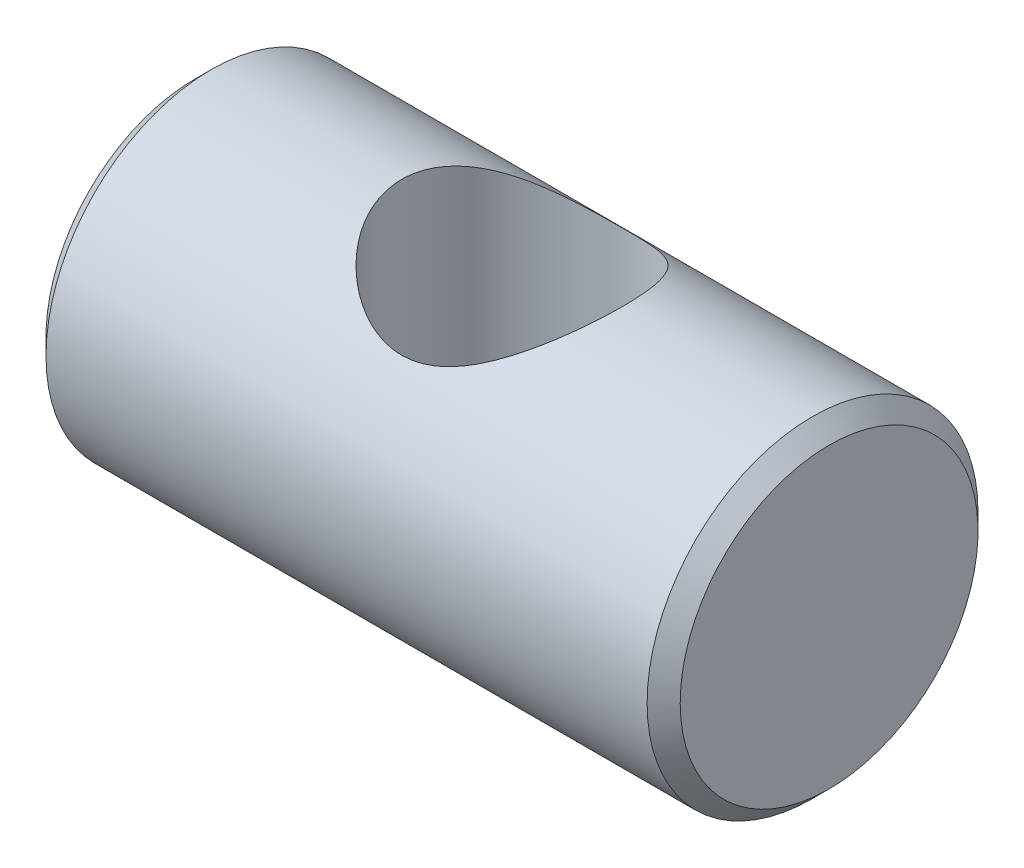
ISO-10303-21;
HEADER;
FILE_DESCRIPTION(('STEP AP214'),'2;1');
FILE_NAME('part.step','',(''),(''),'','','');
FILE_SCHEMA(('AUTOMOTIVE_DESIGN { 1 0 10303 214 1 1 1 1 }'));
ENDSEC;
DATA;
#1=APPLICATION_CONTEXT('core data for automotive mechanical design processes');
#2=APPLICATION_PROTOCOL_DEFINITION('international standard','automotive_design',2000,#1);
#3=PRODUCT_CONTEXT('',#1,'mechanical');
#4=PRODUCT('Part','Part','',(#3));
#5=PRODUCT_RELATED_PRODUCT_CATEGORY('part','',(#4));
#6=PRODUCT_DEFINITION_FORMATION('','',#4);
#7=PRODUCT_DEFINITION_CONTEXT('part definition',#1,'design');
#8=PRODUCT_DEFINITION('design','',#6,#7);
#9=PRODUCT_DEFINITION_SHAPE('','',#8);
#10=(LENGTH_UNIT() NAMED_UNIT(*) SI_UNIT(.MILLI.,.METRE.));
#11=(NAMED_UNIT(*) PLANE_ANGLE_UNIT() SI_UNIT($,.RADIAN.));
#12=(NAMED_UNIT(*) SI_UNIT($,.STERADIAN.) SOLID_ANGLE_UNIT());
#13=UNCERTAINTY_MEASURE_WITH_UNIT(LENGTH_MEASURE(1.E-05),#10,'distance_accuracy_value','');
#14=(GEOMETRIC_REPRESENTATION_CONTEXT(3) GLOBAL_UNCERTAINTY_ASSIGNED_CONTEXT((#13)) GLOBAL_UNIT_ASSIGNED_CONTEXT((#10,
#11,#12)) REPRESENTATION_CONTEXT('',''));
#15=CARTESIAN_POINT('',(0.,0.,0.));
#16=DIRECTION('',(0.,0.,1.));
#17=DIRECTION('',(1.,0.,0.));
#18=AXIS2_PLACEMENT_3D('',#15,#16,#17);
#19=CARTESIAN_POINT('',(5.75,2.7,0.));
#20=DIRECTION('',(-1.,0.,0.));
#21=DIRECTION('',(0.,0.,1.));
#22=AXIS2_PLACEMENT_3D('',#19,#20,#21);
#23=PLANE('',#22);
#24=CARTESIAN_POINT('',(5.75000000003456,0.,0.));
#25=DIRECTION('',(-1.,0.,0.));
#26=DIRECTION('',(0.,0.,1.));
#27=AXIS2_PLACEMENT_3D('',#24,#25,#26);
#28=CIRCLE('',#27,2.70000000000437);
#29=CARTESIAN_POINT('',(5.75000000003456,0.,2.70000000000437));
#30=VERTEX_POINT('',#29);
#31=EDGE_CURVE('E66',#30,#30,#28,.T.);
#32=ORIENTED_EDGE('',*,*,#31,.F.);
#33=EDGE_LOOP('',(#32));
#34=FACE_BOUND('',#33,.T.);
#35=ADVANCED_FACE('F14',(#34),#23,.F.);
#36=CARTESIAN_POINT('',(-5.75,0.,0.));
#37=DIRECTION('',(1.,0.,0.));
#38=DIRECTION('',(0.,0.,-1.));
#39=AXIS2_PLACEMENT_3D('',#36,#37,#38);
#40=PLANE('',#39);
#41=CARTESIAN_POINT('',(-5.74999999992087,0.,0.));
#42=DIRECTION('',(1.,0.,0.));
#43=DIRECTION('',(0.,0.,-1.));
#44=AXIS2_PLACEMENT_3D('',#41,#42,#43);
#45=CIRCLE('',#44,2.70000000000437);
#46=CARTESIAN_POINT('',(-5.74999999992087,0.,-2.70000000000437));
#47=VERTEX_POINT('',#46);
#48=EDGE_CURVE('E68',#47,#47,#45,.T.);
#49=ORIENTED_EDGE('',*,*,#48,.F.);
#50=EDGE_LOOP('',(#49));
#51=FACE_BOUND('',#50,.T.);
#52=ADVANCED_FACE('F56',(#51),#40,.F.);
#53=CARTESIAN_POINT('',(5.45000000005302,0.,0.));
#54=DIRECTION('',(-1.,0.,0.));
#55=DIRECTION('',(0.,0.,1.));
#56=AXIS2_PLACEMENT_3D('',#53,#54,#55);
#57=CONICAL_SURFACE('',#56,2.99999999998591,0.785398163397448);
#58=CARTESIAN_POINT('',(5.45,0.,0.));
#59=DIRECTION('',(1.,0.,0.));
#60=DIRECTION('',(0.,0.,-1.));
#61=AXIS2_PLACEMENT_3D('',#58,#59,#60);
#62=CIRCLE('',#61,3.);
#63=CARTESIAN_POINT('',(5.45,0.,-3.));
#64=VERTEX_POINT('',#63);
#65=EDGE_CURVE('E33',#64,#64,#62,.F.);
#66=ORIENTED_EDGE('',*,*,#65,.F.);
#67=EDGE_LOOP('',(#66));
#68=FACE_BOUND('',#67,.T.);
#69=ORIENTED_EDGE('',*,*,#31,.T.);
#70=EDGE_LOOP('',(#69));
#71=FACE_BOUND('',#70,.T.);
#72=ADVANCED_FACE('F62',(#68,#71),#57,.T.);
#73=CARTESIAN_POINT('',(-5.45000000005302,0.,0.));
#74=DIRECTION('',(1.,0.,0.));
#75=DIRECTION('',(0.,0.,-1.));
#76=AXIS2_PLACEMENT_3D('',#73,#74,#75);
#77=CONICAL_SURFACE('',#76,2.99999999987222,0.785398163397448);
#78=ORIENTED_EDGE('',*,*,#48,.T.);
#79=EDGE_LOOP('',(#78));
#80=FACE_BOUND('',#79,.T.);
#81=CARTESIAN_POINT('',(-5.45,0.,0.));
#82=DIRECTION('',(1.,0.,0.));
#83=DIRECTION('',(0.,0.,-1.));
#84=AXIS2_PLACEMENT_3D('',#81,#82,#83);
#85=CIRCLE('',#84,3.);
#86=CARTESIAN_POINT('',(-5.45,0.,-3.));
#87=VERTEX_POINT('',#86);
#88=EDGE_CURVE('E29',#87,#87,#85,.T.);
#89=ORIENTED_EDGE('',*,*,#88,.F.);
#90=EDGE_LOOP('',(#89));
#91=FACE_BOUND('',#90,.T.);
#92=ADVANCED_FACE('F53',(#80,#91),#77,.T.);
#93=CARTESIAN_POINT('',(5.75,0.,0.));
#94=DIRECTION('',(1.,0.,0.));
#95=DIRECTION('',(0.,0.,-1.));
#96=AXIS2_PLACEMENT_3D('',#93,#94,#95);
#97=CYLINDRICAL_SURFACE('',#96,3.);
#98=CARTESIAN_POINT('',(2.,-3.,0.));
#99=CARTESIAN_POINT('',(2.00000054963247,-3.0000004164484,0.100484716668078));
#100=CARTESIAN_POINT('',(1.9923860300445,-2.99490802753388,0.200969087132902));
#101=CARTESIAN_POINT('',(1.96240313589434,-2.97504652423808,0.398733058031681));
#102=CARTESIAN_POINT('',(1.9400277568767,-2.96027281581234,0.496011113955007));
#103=CARTESIAN_POINT('',(1.88189228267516,-2.92250482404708,0.684212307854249));
#104=CARTESIAN_POINT('',(1.84619485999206,-2.89954905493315,0.775162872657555));
#105=CARTESIAN_POINT('',(1.7629366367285,-2.8472613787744,0.94941529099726));
#106=CARTESIAN_POINT('',(1.71537411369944,-2.8179285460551,1.03271603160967));
#107=CARTESIAN_POINT('',(1.60534306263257,-2.75227329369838,1.19728470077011));
#108=CARTESIAN_POINT('',(1.54195213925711,-2.71556897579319,1.27778030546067));
#109=CARTESIAN_POINT('',(1.40426995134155,-2.63982313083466,1.42772804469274));
#110=CARTESIAN_POINT('',(1.32996307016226,-2.60077830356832,1.49716405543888));
#111=CARTESIAN_POINT('',(1.15894763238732,-2.51728264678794,1.63422297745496));
#112=CARTESIAN_POINT('',(1.06055434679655,-2.47295067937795,1.6998318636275));
#113=CARTESIAN_POINT('',(0.851636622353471,-2.3908414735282,1.81350357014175));
#114=CARTESIAN_POINT('',(0.741133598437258,-2.35305295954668,1.86159673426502));
#115=CARTESIAN_POINT('',(0.543288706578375,-2.29976266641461,1.92674035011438));
#116=CARTESIAN_POINT('',(0.458471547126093,-2.28097627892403,1.94874447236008));
#117=CARTESIAN_POINT('',(0.285255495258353,-2.25257969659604,1.98150617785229));
#118=CARTESIAN_POINT('',(0.19686305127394,-2.24295368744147,1.99228314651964));
#119=CARTESIAN_POINT('',(0.0185252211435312,-2.23436605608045,2.00191364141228));
#120=CARTESIAN_POINT('',(-0.0714250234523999,-2.23544802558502,2.00071842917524));
#121=CARTESIAN_POINT('',(-0.249634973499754,-2.24819775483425,1.98637581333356));
#122=CARTESIAN_POINT('',(-0.337893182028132,-2.25987448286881,1.97321828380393));
#123=CARTESIAN_POINT('',(-0.506467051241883,-2.29127185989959,1.93664994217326));
#124=CARTESIAN_POINT('',(-0.586961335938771,-2.31061488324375,1.91371711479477));
#125=CARTESIAN_POINT('',(-0.743023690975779,-2.35509622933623,1.85870118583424));
#126=CARTESIAN_POINT('',(-0.818590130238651,-2.3802364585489,1.8266150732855));
#127=CARTESIAN_POINT('',(-0.979025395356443,-2.43964196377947,1.74673818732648));
#128=CARTESIAN_POINT('',(-1.06265990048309,-2.47472317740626,1.69708052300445));
#129=CARTESIAN_POINT('',(-1.22138339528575,-2.54691537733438,1.58668960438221));
#130=CARTESIAN_POINT('',(-1.29646165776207,-2.58402882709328,1.52594268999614));
#131=CARTESIAN_POINT('',(-1.45254254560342,-2.66543343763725,1.37981165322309));
#132=CARTESIAN_POINT('',(-1.53133404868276,-2.7095474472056,1.29193938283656));
#133=CARTESIAN_POINT('',(-1.67319649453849,-2.79218100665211,1.10200799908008));
#134=CARTESIAN_POINT('',(-1.73628214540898,-2.83070577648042,0.999962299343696));
#135=CARTESIAN_POINT('',(-1.83347771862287,-2.89145404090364,0.80485782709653));
#136=CARTESIAN_POINT('',(-1.87084336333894,-2.9153926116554,0.71395764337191));
#137=CARTESIAN_POINT('',(-1.93210492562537,-2.95507719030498,0.526036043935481));
#138=CARTESIAN_POINT('',(-1.95601222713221,-2.97083012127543,0.42901987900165));
#139=CARTESIAN_POINT('',(-1.98916116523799,-2.99275882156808,0.23098545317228));
#140=CARTESIAN_POINT('',(-1.99833946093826,-2.99889322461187,0.129951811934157));
#141=CARTESIAN_POINT('',(-2.00124708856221,-3.00083114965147,-0.0724415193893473));
#142=CARTESIAN_POINT('',(-1.99497750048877,-2.99663539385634,-0.173801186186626));
#143=CARTESIAN_POINT('',(-1.96837594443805,-2.97899589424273,-0.366455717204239));
#144=CARTESIAN_POINT('',(-1.94906270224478,-2.96622246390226,-0.457957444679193));
#145=CARTESIAN_POINT('',(-1.89840431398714,-2.93318449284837,-0.636116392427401));
#146=CARTESIAN_POINT('',(-1.86705724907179,-2.91291875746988,-0.722772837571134));
#147=CARTESIAN_POINT('',(-1.79134770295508,-2.86496352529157,-0.894664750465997));
#148=CARTESIAN_POINT('',(-1.74631184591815,-2.83689870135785,-0.979496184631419));
#149=CARTESIAN_POINT('',(-1.64556671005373,-2.77601855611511,-1.14068302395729));
#150=CARTESIAN_POINT('',(-1.58985083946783,-2.74320030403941,-1.21703314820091));
#151=CARTESIAN_POINT('',(-1.45939213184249,-2.6695454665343,-1.37185445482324));
#152=CARTESIAN_POINT('',(-1.38303373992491,-2.62826156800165,-1.44875187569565));
#153=CARTESIAN_POINT('',(-1.21888857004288,-2.54571173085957,-1.58933968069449));
#154=CARTESIAN_POINT('',(-1.13109396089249,-2.50444582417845,-1.6530209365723));
#155=CARTESIAN_POINT('',(-0.952857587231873,-2.4293967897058,-1.76124776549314));
#156=CARTESIAN_POINT('',(-0.863267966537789,-2.39527597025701,-1.80695636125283));
#157=CARTESIAN_POINT('',(-0.676127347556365,-2.33438974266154,-1.88496213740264));
#158=CARTESIAN_POINT('',(-0.578591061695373,-2.30761112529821,-1.91728345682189));
#159=CARTESIAN_POINT('',(-0.395435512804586,-2.26933208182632,-1.9623584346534));
#160=CARTESIAN_POINT('',(-0.310828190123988,-2.25594998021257,-1.97758597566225));
#161=CARTESIAN_POINT('',(-0.139426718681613,-2.23879466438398,-1.99699205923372));
#162=CARTESIAN_POINT('',(-0.0526350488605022,-2.23501101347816,-2.00118260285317));
#163=CARTESIAN_POINT('',(0.120643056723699,-2.23764201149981,-1.99823921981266));
#164=CARTESIAN_POINT('',(0.207129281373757,-2.24406269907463,-1.99109858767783));
#165=CARTESIAN_POINT('',(0.377343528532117,-2.26610452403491,-1.96596997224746));
#166=CARTESIAN_POINT('',(0.461067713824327,-2.28173793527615,-1.94796751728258));
#167=CARTESIAN_POINT('',(0.645711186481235,-2.32526843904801,-1.89593035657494));
#168=CARTESIAN_POINT('',(0.745267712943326,-2.35532333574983,-1.85890187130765));
#169=CARTESIAN_POINT('',(0.935486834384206,-2.42222161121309,-1.7708452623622));
#170=CARTESIAN_POINT('',(1.02613669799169,-2.45907449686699,-1.71979748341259));
#171=CARTESIAN_POINT('',(1.19928188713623,-2.53617186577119,-1.60398280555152));
#172=CARTESIAN_POINT('',(1.28159874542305,-2.5764658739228,-1.53898309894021));
#173=CARTESIAN_POINT('',(1.43532247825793,-2.65628301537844,-1.39671768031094));
#174=CARTESIAN_POINT('',(1.50672599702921,-2.69580590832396,-1.31944821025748));
#175=CARTESIAN_POINT('',(1.64671210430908,-2.77631551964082,-1.14145732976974));
#176=CARTESIAN_POINT('',(1.71341864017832,-2.81669805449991,-1.03896166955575));
#177=CARTESIAN_POINT('',(1.8279132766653,-2.88777665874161,-0.820868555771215));
#178=CARTESIAN_POINT('',(1.87573110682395,-2.91848793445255,-0.705292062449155));
#179=CARTESIAN_POINT('',(1.94115457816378,-2.96101644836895,-0.491435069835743));
#180=CARTESIAN_POINT('',(1.96311103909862,-2.97551480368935,-0.395012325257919));
#181=CARTESIAN_POINT('',(1.9925280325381,-2.99500280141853,-0.199058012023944));
#182=CARTESIAN_POINT('',(1.99999945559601,-2.99999958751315,-0.0995288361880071));
#183=CARTESIAN_POINT('',(2.,-3.,0.));
#184=B_SPLINE_CURVE_WITH_KNOTS('',3,(#98,#99,#100,#101,#102,#103,#104,#105,#106,#107,#108,#109,
#110,#111,#112,#113,#114,#115,#116,#117,#118,#119,#120,#121,#122,#123,#124,#125,#126,#127,#128,
#129,#130,#131,#132,#133,#134,#135,#136,#137,#138,#139,#140,#141,#142,#143,#144,#145,#146,#147,
#148,#149,#150,#151,#152,#153,#154,#155,#156,#157,#158,#159,#160,#161,#162,#163,#164,#165,#166,
#167,#168,#169,#170,#171,#172,#173,#174,#175,#176,#177,#178,#179,#180,#181,#182,#183),
.UNSPECIFIED.,.T.,.F.,(4,2,2,2,2,2,2,2,2,2,2,2,2,2,2,2,2,2,2,2,2,2,2,2,2,2,2,2,2,2,2,2,2,2,2,2,
2,2,2,2,2,2,4),(0.,0.3010532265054,0.602249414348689,0.902046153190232,1.20188643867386,
1.52717029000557,1.85292411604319,2.23006683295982,2.60655305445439,2.87433693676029,
3.14165767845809,3.41006711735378,3.67870397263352,3.93548862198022,4.19235783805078,
4.50147574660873,4.81097703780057,5.18718954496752,5.56304840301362,5.86524087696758,
6.16717735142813,6.47040883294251,6.77361911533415,7.05553084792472,7.3374875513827,
7.63652346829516,7.93574454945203,8.28228176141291,8.62905753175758,8.94649935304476,
9.26336626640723,9.52324048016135,9.78283200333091,10.0425772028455,10.302669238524,
10.6320660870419,10.9619271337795,11.2977924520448,11.6337608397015,12.0179535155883,
12.4015390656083,12.6999529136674,12.9981423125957),.UNSPECIFIED.);
#185=CARTESIAN_POINT('',(2.,-3.,0.));
#186=VERTEX_POINT('',#185);
#187=EDGE_CURVE('E10',#186,#186,#184,.T.);
#188=ORIENTED_EDGE('',*,*,#187,.F.);
#189=EDGE_LOOP('',(#188));
#190=FACE_BOUND('',#189,.T.);
#191=CARTESIAN_POINT('',(0.,2.23606797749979,2.));
#192=CARTESIAN_POINT('',(0.0976283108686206,2.23607753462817,1.99999453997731));
#193=CARTESIAN_POINT('',(0.195290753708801,2.24258071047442,1.99278992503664));
#194=CARTESIAN_POINT('',(0.387119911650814,2.26731972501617,1.96458268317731));
#195=CARTESIAN_POINT('',(0.481280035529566,2.2855766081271,1.94355530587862));
#196=CARTESIAN_POINT('',(0.662735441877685,2.3305658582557,1.88935861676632));
#197=CARTESIAN_POINT('',(0.750087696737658,2.35721561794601,1.85630718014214));
#198=CARTESIAN_POINT('',(0.917865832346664,2.41584094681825,1.77934008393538));
#199=CARTESIAN_POINT('',(0.998290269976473,2.44781762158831,1.73542216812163));
#200=CARTESIAN_POINT('',(1.16364688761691,2.51946072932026,1.63002410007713));
#201=CARTESIAN_POINT('',(1.2473321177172,2.55954936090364,1.56687435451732));
#202=CARTESIAN_POINT('',(1.40400270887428,2.63944827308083,1.4281921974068));
#203=CARTESIAN_POINT('',(1.47697752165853,2.67925824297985,1.3526477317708));
#204=CARTESIAN_POINT('',(1.62064365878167,2.76088818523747,1.17815690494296));
#205=CARTESIAN_POINT('',(1.68948251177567,2.80216785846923,1.07740643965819));
#206=CARTESIAN_POINT('',(1.80864209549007,2.87558484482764,0.862470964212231));
#207=CARTESIAN_POINT('',(1.85898351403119,2.90773236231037,0.748301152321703));
#208=CARTESIAN_POINT('',(1.93355640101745,2.95599907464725,0.523249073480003));
#209=CARTESIAN_POINT('',(1.96008334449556,2.97351175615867,0.413434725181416));
#210=CARTESIAN_POINT('',(1.99418448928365,2.99609745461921,0.189695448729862));
#211=CARTESIAN_POINT('',(2.00178255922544,3.00118613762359,0.0757758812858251));
#212=CARTESIAN_POINT('',(1.99782755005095,2.99855361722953,-0.134147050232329));
#213=CARTESIAN_POINT('',(1.98901094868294,2.99266264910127,-0.230240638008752));
#214=CARTESIAN_POINT('',(1.95790894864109,2.9720818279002,-0.419238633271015));
#215=CARTESIAN_POINT('',(1.93562256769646,2.95739133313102,-0.512142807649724));
#216=CARTESIAN_POINT('',(1.87880431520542,2.92052091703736,-0.692077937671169));
#217=CARTESIAN_POINT('',(1.84432111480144,2.89837077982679,-0.779130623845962));
#218=CARTESIAN_POINT('',(1.76444635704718,2.84821104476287,-0.946209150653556));
#219=CARTESIAN_POINT('',(1.71905280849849,2.82020037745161,-1.0262337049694));
#220=CARTESIAN_POINT('',(1.61202126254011,2.75618058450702,-1.18828429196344));
#221=CARTESIAN_POINT('',(1.54903247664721,2.71960408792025,-1.26919148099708));
#222=CARTESIAN_POINT('',(1.41210132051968,2.64400601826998,-1.41998807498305));
#223=CARTESIAN_POINT('',(1.33814205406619,2.60498072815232,-1.48986013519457));
#224=CARTESIAN_POINT('',(1.16803678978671,2.52150044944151,-1.62772235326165));
#225=CARTESIAN_POINT('',(1.07022892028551,2.47714320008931,-1.69373593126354));
#226=CARTESIAN_POINT('',(0.862490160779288,2.39475610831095,-1.80834874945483));
#227=CARTESIAN_POINT('',(0.752580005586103,2.3567157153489,-1.85697718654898));
#228=CARTESIAN_POINT('',(0.555280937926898,2.30262870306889,-1.92332724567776));
#229=CARTESIAN_POINT('',(0.470406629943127,2.28340364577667,-1.94590791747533));
#230=CARTESIAN_POINT('',(0.296960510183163,2.25409039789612,-1.97979555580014));
#231=CARTESIAN_POINT('',(0.208395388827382,2.24398636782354,-1.99112206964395));
#232=CARTESIAN_POINT('',(0.029557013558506,2.23447556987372,-2.00179400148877));
#233=CARTESIAN_POINT('',(-0.0607219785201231,2.2351153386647,-2.00108729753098));
#234=CARTESIAN_POINT('',(-0.239683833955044,2.24709880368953,-1.98761629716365));
#235=CARTESIAN_POINT('',(-0.328365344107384,2.25845117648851,-1.97484222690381));
#236=CARTESIAN_POINT('',(-0.497389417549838,2.28927977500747,-1.93899811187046));
#237=CARTESIAN_POINT('',(-0.577927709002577,2.30833187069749,-1.91646174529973));
#238=CARTESIAN_POINT('',(-0.734126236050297,2.3522995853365,-1.86223041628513));
#239=CARTESIAN_POINT('',(-0.809784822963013,2.3772171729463,-1.83053237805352));
#240=CARTESIAN_POINT('',(-0.970202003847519,2.43611483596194,-1.75163346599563));
#241=CARTESIAN_POINT('',(-1.05375681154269,2.47091081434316,-1.70260028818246));
#242=CARTESIAN_POINT('',(-1.21241680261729,2.54262514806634,-1.59352731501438));
#243=CARTESIAN_POINT('',(-1.28751151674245,2.57954604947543,-1.53347411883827));
#244=CARTESIAN_POINT('',(-1.44396234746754,2.66075678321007,-1.38876657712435));
#245=CARTESIAN_POINT('',(-1.52310284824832,2.70489452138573,-1.30160386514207));
#246=CARTESIAN_POINT('',(-1.66581668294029,2.78775581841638,-1.11309948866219));
#247=CARTESIAN_POINT('',(-1.72940377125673,2.82648414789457,-1.011770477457));
#248=CARTESIAN_POINT('',(-1.82789173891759,2.88790821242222,-0.817487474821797));
#249=CARTESIAN_POINT('',(-1.86595650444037,2.91225458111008,-0.72666236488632));
#250=CARTESIAN_POINT('',(-1.92860719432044,2.95278707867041,-0.538757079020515));
#251=CARTESIAN_POINT('',(-1.95320450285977,2.96898009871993,-0.44168226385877));
#252=CARTESIAN_POINT('',(-1.98769696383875,2.99178364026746,-0.243369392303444));
#253=CARTESIAN_POINT('',(-1.99752667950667,2.99835150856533,-0.142114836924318));
#254=CARTESIAN_POINT('',(-2.00164785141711,3.00109821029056,0.0608555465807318));
#255=CARTESIAN_POINT('',(-1.99594075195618,2.99727800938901,0.162571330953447));
#256=CARTESIAN_POINT('',(-1.9703405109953,2.98029555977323,0.355757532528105));
#257=CARTESIAN_POINT('',(-1.95150901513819,2.96783277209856,0.44743514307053));
#258=CARTESIAN_POINT('',(-1.9017619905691,2.93536106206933,0.626018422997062));
#259=CARTESIAN_POINT('',(-1.87084458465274,2.91535096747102,0.71292334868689));
#260=CARTESIAN_POINT('',(-1.79606129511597,2.86791765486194,0.885147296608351));
#261=CARTESIAN_POINT('',(-1.75154969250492,2.84013248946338,0.970083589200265));
#262=CARTESIAN_POINT('',(-1.65184935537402,2.77975408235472,1.13155266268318));
#263=CARTESIAN_POINT('',(-1.596654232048,2.74715796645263,1.20808037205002));
#264=CARTESIAN_POINT('',(-1.46737109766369,2.67392931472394,1.36329422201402));
#265=CARTESIAN_POINT('',(-1.39167697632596,2.6328391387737,1.44042679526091));
#266=CARTESIAN_POINT('',(-1.22888645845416,2.55053357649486,1.58160022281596));
#267=CARTESIAN_POINT('',(-1.14178161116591,2.50931811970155,1.64563128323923));
#268=CARTESIAN_POINT('',(-0.964132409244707,2.43384213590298,1.75513253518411));
#269=CARTESIAN_POINT('',(-0.874358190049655,2.39929086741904,1.8016464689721));
#270=CARTESIAN_POINT('',(-0.68671555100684,2.33747501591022,1.88115802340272));
#271=CARTESIAN_POINT('',(-0.588863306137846,2.31019631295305,1.91418190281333));
#272=CARTESIAN_POINT('',(-0.40922853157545,2.27191051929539,1.95936262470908));
#273=CARTESIAN_POINT('',(-0.328691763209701,2.25863695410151,1.97452228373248));
#274=CARTESIAN_POINT('',(-0.165443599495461,2.24071519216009,1.99483915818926));
#275=CARTESIAN_POINT('',(-0.0827340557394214,2.23605987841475,2.00000462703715));
#276=CARTESIAN_POINT('',(0.,2.23606797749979,2.));
#277=B_SPLINE_CURVE_WITH_KNOTS('',3,(#191,#192,#193,#194,#195,#196,#197,#198,#199,#200,#201,
#202,#203,#204,#205,#206,#207,#208,#209,#210,#211,#212,#213,#214,#215,#216,#217,#218,#219,#220,
#221,#222,#223,#224,#225,#226,#227,#228,#229,#230,#231,#232,#233,#234,#235,#236,#237,#238,#239,
#240,#241,#242,#243,#244,#245,#246,#247,#248,#249,#250,#251,#252,#253,#254,#255,#256,#257,#258,
#259,#260,#261,#262,#263,#264,#265,#266,#267,#268,#269,#270,#271,#272,#273,#274,#275,#276),
.UNSPECIFIED.,.T.,.F.,(4,2,2,2,2,2,2,2,2,2,2,2,2,2,2,2,2,2,2,2,2,2,2,2,2,2,2,2,2,2,2,2,2,2,2,2,
2,2,2,2,2,2,4),(0.,0.292506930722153,0.585539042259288,0.875772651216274,1.16606657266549,
1.50154677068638,1.83735518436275,2.22167031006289,2.6055542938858,2.94637482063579,
3.28676536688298,3.57539534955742,3.86404638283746,4.15155831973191,4.43912276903,
4.76447525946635,5.09033414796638,5.46678703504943,5.84260469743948,6.11126090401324,
6.37944966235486,6.64880037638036,6.91836943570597,7.17476451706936,7.43124577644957,
7.73899230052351,8.04711556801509,8.42254684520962,8.7976449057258,9.10070580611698,
9.40351012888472,9.70765229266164,10.0117661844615,10.2937678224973,10.5758132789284,
10.874178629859,11.1727229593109,11.5182220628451,11.863978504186,12.1833412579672,
12.5020793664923,12.7501661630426,12.9980479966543),.UNSPECIFIED.);
#278=CARTESIAN_POINT('',(0.,2.23606797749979,2.));
#279=VERTEX_POINT('',#278);
#280=EDGE_CURVE('E25',#279,#279,#277,.T.);
#281=ORIENTED_EDGE('',*,*,#280,.F.);
#282=EDGE_LOOP('',(#281));
#283=FACE_BOUND('',#282,.T.);
#284=ORIENTED_EDGE('',*,*,#88,.T.);
#285=EDGE_LOOP('',(#284));
#286=FACE_BOUND('',#285,.T.);
#287=ORIENTED_EDGE('',*,*,#65,.T.);
#288=EDGE_LOOP('',(#287));
#289=FACE_BOUND('',#288,.T.);
#290=ADVANCED_FACE('F41',(#190,#283,#286,#289),#97,.T.);
#291=CARTESIAN_POINT('',(0.,-3.,0.));
#292=DIRECTION('',(0.,1.,0.));
#293=DIRECTION('',(0.,0.,1.));
#294=AXIS2_PLACEMENT_3D('',#291,#292,#293);
#295=CYLINDRICAL_SURFACE('',#294,2.);
#296=ORIENTED_EDGE('',*,*,#187,.T.);
#297=EDGE_LOOP('',(#296));
#298=FACE_BOUND('',#297,.T.);
#299=ORIENTED_EDGE('',*,*,#280,.T.);
#300=EDGE_LOOP('',(#299));
#301=FACE_BOUND('',#300,.T.);
#302=ADVANCED_FACE('F44',(#298,#301),#295,.F.);
#303=CLOSED_SHELL('',(#35,#52,#72,#92,#290,#302));
#304=MANIFOLD_SOLID_BREP('B1',#303);
#305=ADVANCED_BREP_SHAPE_REPRESENTATION('',(#18,#304),#14);
#306=SHAPE_DEFINITION_REPRESENTATION(#9,#305);
ENDSEC;
END-ISO-10303-21;
